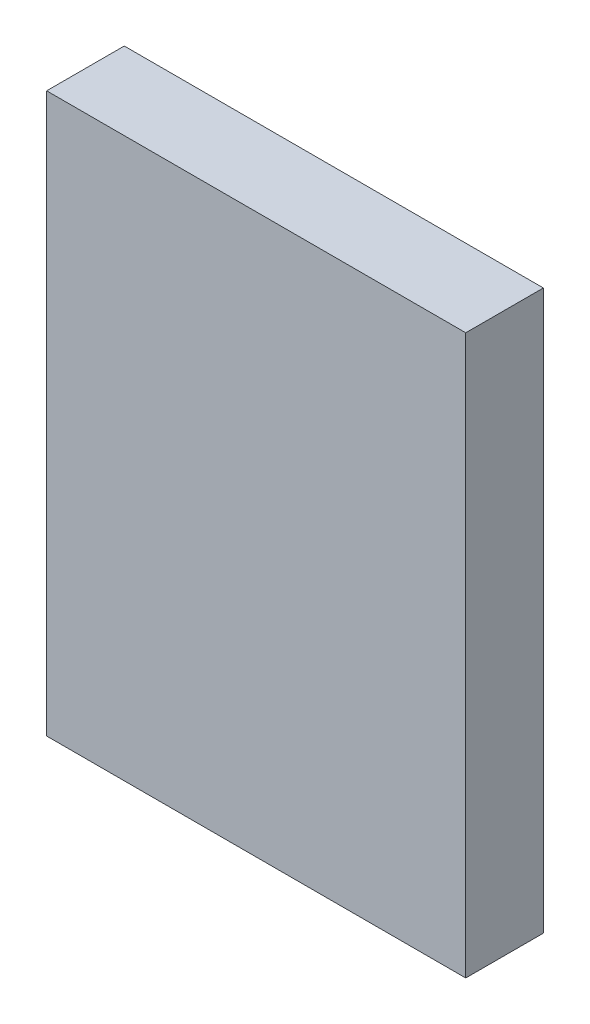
from build123d import *

# Parameters (mm, degrees)
SKICA1_W        = 27
SKICA1_H        = 36
VYSUNOUT1_DEPTH = 5


with BuildPart() as part:
    # Skica1 → Vysunout1 (new body)
    with BuildSketch(Plane.XY):
        Rectangle(SKICA1_W, SKICA1_H)
    extrude(amount=VYSUNOUT1_DEPTH)


solid = part.part
